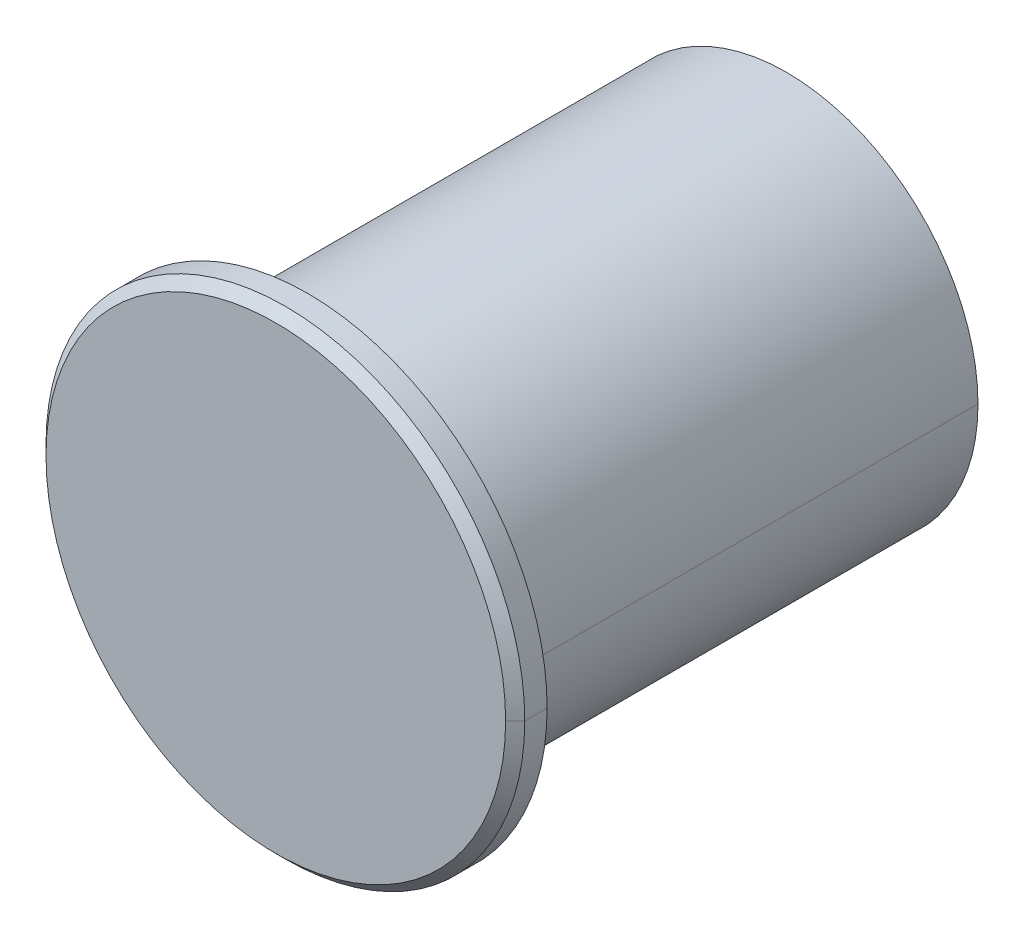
ISO-10303-21;
HEADER;
FILE_DESCRIPTION(('STEP AP214'),'2;1');
FILE_NAME('part.step','',(''),(''),'','','');
FILE_SCHEMA(('AUTOMOTIVE_DESIGN { 1 0 10303 214 1 1 1 1 }'));
ENDSEC;
DATA;
#1=APPLICATION_CONTEXT('core data for automotive mechanical design processes');
#2=APPLICATION_PROTOCOL_DEFINITION('international standard','automotive_design',2000,#1);
#3=PRODUCT_CONTEXT('',#1,'mechanical');
#4=PRODUCT('Part','Part','',(#3));
#5=PRODUCT_RELATED_PRODUCT_CATEGORY('part','',(#4));
#6=PRODUCT_DEFINITION_FORMATION('','',#4);
#7=PRODUCT_DEFINITION_CONTEXT('part definition',#1,'design');
#8=PRODUCT_DEFINITION('design','',#6,#7);
#9=PRODUCT_DEFINITION_SHAPE('','',#8);
#10=(LENGTH_UNIT() NAMED_UNIT(*) SI_UNIT(.MILLI.,.METRE.));
#11=(NAMED_UNIT(*) PLANE_ANGLE_UNIT() SI_UNIT($,.RADIAN.));
#12=(NAMED_UNIT(*) SI_UNIT($,.STERADIAN.) SOLID_ANGLE_UNIT());
#13=UNCERTAINTY_MEASURE_WITH_UNIT(LENGTH_MEASURE(1.E-05),#10,'distance_accuracy_value','');
#14=(GEOMETRIC_REPRESENTATION_CONTEXT(3) GLOBAL_UNCERTAINTY_ASSIGNED_CONTEXT((#13)) GLOBAL_UNIT_ASSIGNED_CONTEXT((#10,
#11,#12)) REPRESENTATION_CONTEXT('',''));
#15=CARTESIAN_POINT('',(0.,0.,0.));
#16=DIRECTION('',(0.,0.,1.));
#17=DIRECTION('',(1.,0.,0.));
#18=AXIS2_PLACEMENT_3D('',#15,#16,#17);
#19=CARTESIAN_POINT('',(0.,0.,0.));
#20=DIRECTION('',(0.,0.,1.));
#21=DIRECTION('',(1.,0.,0.));
#22=AXIS2_PLACEMENT_3D('',#19,#20,#21);
#23=PLANE('',#22);
#24=CARTESIAN_POINT('',(0.,0.,0.));
#25=DIRECTION('',(0.,0.,1.));
#26=DIRECTION('',(1.,0.,0.));
#27=AXIS2_PLACEMENT_3D('',#24,#25,#26);
#28=CIRCLE('',#27,7.2);
#29=CARTESIAN_POINT('',(-7.2,0.,0.));
#30=VERTEX_POINT('',#29);
#31=CARTESIAN_POINT('',(7.2,0.,0.));
#32=VERTEX_POINT('',#31);
#33=EDGE_CURVE('E9',#30,#32,#28,.T.);
#34=ORIENTED_EDGE('',*,*,#33,.T.);
#35=CARTESIAN_POINT('',(0.,0.,0.));
#36=DIRECTION('',(0.,0.,1.));
#37=DIRECTION('',(1.,0.,0.));
#38=AXIS2_PLACEMENT_3D('',#35,#36,#37);
#39=CIRCLE('',#38,7.2);
#40=EDGE_CURVE('E72',#32,#30,#39,.T.);
#41=ORIENTED_EDGE('',*,*,#40,.T.);
#42=EDGE_LOOP('',(#34,#41));
#43=FACE_BOUND('',#42,.T.);
#44=ADVANCED_FACE('F15',(#43),#23,.T.);
#45=CARTESIAN_POINT('',(0.,0.,-0.3));
#46=DIRECTION('',(0.,0.,-1.));
#47=DIRECTION('',(-1.,0.,0.));
#48=AXIS2_PLACEMENT_3D('',#45,#46,#47);
#49=CONICAL_SURFACE('',#48,7.5,0.785398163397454);
#50=DIRECTION('',(0.707106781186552,0.,-0.707106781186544));
#51=VECTOR('',#50,1.);
#52=CARTESIAN_POINT('',(7.5,0.,-0.3));
#53=LINE('',#52,#51);
#54=CARTESIAN_POINT('',(7.5,0.,-0.3));
#55=VERTEX_POINT('',#54);
#56=EDGE_CURVE('E77',#32,#55,#53,.T.);
#57=ORIENTED_EDGE('',*,*,#56,.F.);
#58=ORIENTED_EDGE('',*,*,#33,.F.);
#59=DIRECTION('',(-0.707106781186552,0.,-0.707106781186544));
#60=VECTOR('',#59,1.);
#61=CARTESIAN_POINT('',(-7.5,0.,-0.3));
#62=LINE('',#61,#60);
#63=CARTESIAN_POINT('',(-7.5,0.,-0.3));
#64=VERTEX_POINT('',#63);
#65=EDGE_CURVE('E85',#30,#64,#62,.T.);
#66=ORIENTED_EDGE('',*,*,#65,.T.);
#67=CARTESIAN_POINT('',(0.,0.,-0.3));
#68=DIRECTION('',(0.,0.,1.));
#69=DIRECTION('',(1.,0.,0.));
#70=AXIS2_PLACEMENT_3D('',#67,#68,#69);
#71=CIRCLE('',#70,7.5);
#72=EDGE_CURVE('E24',#64,#55,#71,.T.);
#73=ORIENTED_EDGE('',*,*,#72,.T.);
#74=EDGE_LOOP('',(#57,#58,#66,#73));
#75=FACE_BOUND('',#74,.T.);
#76=ADVANCED_FACE('F17',(#75),#49,.T.);
#77=CARTESIAN_POINT('',(0.,0.,1.01));
#78=DIRECTION('',(0.,0.,1.));
#79=DIRECTION('',(1.,0.,0.));
#80=AXIS2_PLACEMENT_3D('',#77,#78,#79);
#81=CYLINDRICAL_SURFACE('',#80,7.5);
#82=DIRECTION('',(0.,0.,1.));
#83=VECTOR('',#82,1.);
#84=CARTESIAN_POINT('',(-7.5,0.,1.01));
#85=LINE('',#84,#83);
#86=CARTESIAN_POINT('',(-7.5,0.,-1.));
#87=VERTEX_POINT('',#86);
#88=EDGE_CURVE('E97',#87,#64,#85,.T.);
#89=ORIENTED_EDGE('',*,*,#88,.F.);
#90=CARTESIAN_POINT('',(0.,0.,-1.));
#91=DIRECTION('',(0.,0.,1.));
#92=DIRECTION('',(1.,0.,0.));
#93=AXIS2_PLACEMENT_3D('',#90,#91,#92);
#94=CIRCLE('',#93,7.5);
#95=CARTESIAN_POINT('',(7.5,0.,-1.));
#96=VERTEX_POINT('',#95);
#97=EDGE_CURVE('E111',#87,#96,#94,.T.);
#98=ORIENTED_EDGE('',*,*,#97,.T.);
#99=DIRECTION('',(0.,0.,1.));
#100=VECTOR('',#99,1.);
#101=CARTESIAN_POINT('',(7.5,0.,1.01));
#102=LINE('',#101,#100);
#103=EDGE_CURVE('E101',#96,#55,#102,.T.);
#104=ORIENTED_EDGE('',*,*,#103,.T.);
#105=ORIENTED_EDGE('',*,*,#72,.F.);
#106=EDGE_LOOP('',(#89,#98,#104,#105));
#107=FACE_BOUND('',#106,.T.);
#108=ADVANCED_FACE('F129',(#107),#81,.T.);
#109=CARTESIAN_POINT('',(0.,6.,-1.));
#110=DIRECTION('',(0.,0.,1.));
#111=DIRECTION('',(1.,0.,0.));
#112=AXIS2_PLACEMENT_3D('',#109,#110,#111);
#113=PLANE('',#112);
#114=CARTESIAN_POINT('',(0.,0.,-1.));
#115=DIRECTION('',(0.,0.,1.));
#116=DIRECTION('',(1.,0.,0.));
#117=AXIS2_PLACEMENT_3D('',#114,#115,#116);
#118=CIRCLE('',#117,6.);
#119=CARTESIAN_POINT('',(6.,0.,-1.));
#120=VERTEX_POINT('',#119);
#121=CARTESIAN_POINT('',(-6.,0.,-1.));
#122=VERTEX_POINT('',#121);
#123=EDGE_CURVE('E116',#120,#122,#118,.T.);
#124=ORIENTED_EDGE('',*,*,#123,.T.);
#125=CARTESIAN_POINT('',(0.,0.,-1.));
#126=DIRECTION('',(0.,0.,1.));
#127=DIRECTION('',(1.,0.,0.));
#128=AXIS2_PLACEMENT_3D('',#125,#126,#127);
#129=CIRCLE('',#128,6.);
#130=EDGE_CURVE('E33',#122,#120,#129,.T.);
#131=ORIENTED_EDGE('',*,*,#130,.T.);
#132=EDGE_LOOP('',(#124,#131));
#133=FACE_BOUND('',#132,.T.);
#134=CARTESIAN_POINT('',(0.,0.,-1.));
#135=DIRECTION('',(0.,0.,1.));
#136=DIRECTION('',(1.,0.,0.));
#137=AXIS2_PLACEMENT_3D('',#134,#135,#136);
#138=CIRCLE('',#137,7.5);
#139=EDGE_CURVE('E93',#96,#87,#138,.T.);
#140=ORIENTED_EDGE('',*,*,#139,.F.);
#141=ORIENTED_EDGE('',*,*,#97,.F.);
#142=EDGE_LOOP('',(#140,#141));
#143=FACE_BOUND('',#142,.T.);
#144=ADVANCED_FACE('F135',(#133,#143),#113,.F.);
#145=CARTESIAN_POINT('',(0.,0.,-16.));
#146=DIRECTION('',(0.,0.,1.));
#147=DIRECTION('',(1.,0.,0.));
#148=AXIS2_PLACEMENT_3D('',#145,#146,#147);
#149=PLANE('',#148);
#150=CARTESIAN_POINT('',(0.,0.,-16.));
#151=DIRECTION('',(0.,0.,1.));
#152=DIRECTION('',(1.,0.,0.));
#153=AXIS2_PLACEMENT_3D('',#150,#151,#152);
#154=CIRCLE('',#153,6.);
#155=CARTESIAN_POINT('',(6.,0.,-16.));
#156=VERTEX_POINT('',#155);
#157=CARTESIAN_POINT('',(-6.,0.,-16.));
#158=VERTEX_POINT('',#157);
#159=EDGE_CURVE('E104',#156,#158,#154,.T.);
#160=ORIENTED_EDGE('',*,*,#159,.F.);
#161=CARTESIAN_POINT('',(0.,0.,-16.));
#162=DIRECTION('',(0.,0.,1.));
#163=DIRECTION('',(1.,0.,0.));
#164=AXIS2_PLACEMENT_3D('',#161,#162,#163);
#165=CIRCLE('',#164,6.);
#166=EDGE_CURVE('E112',#158,#156,#165,.T.);
#167=ORIENTED_EDGE('',*,*,#166,.F.);
#168=EDGE_LOOP('',(#160,#167));
#169=FACE_BOUND('',#168,.T.);
#170=ADVANCED_FACE('F137',(#169),#149,.F.);
#171=CARTESIAN_POINT('',(0.,0.,-16.));
#172=DIRECTION('',(0.,0.,1.));
#173=DIRECTION('',(1.,0.,0.));
#174=AXIS2_PLACEMENT_3D('',#171,#172,#173);
#175=CYLINDRICAL_SURFACE('',#174,6.);
#176=DIRECTION('',(0.,0.,1.));
#177=VECTOR('',#176,1.);
#178=CARTESIAN_POINT('',(-6.,0.,-16.));
#179=LINE('',#178,#177);
#180=EDGE_CURVE('E108',#158,#122,#179,.T.);
#181=ORIENTED_EDGE('',*,*,#180,.F.);
#182=ORIENTED_EDGE('',*,*,#166,.T.);
#183=DIRECTION('',(0.,0.,1.));
#184=VECTOR('',#183,1.);
#185=CARTESIAN_POINT('',(6.,0.,-16.));
#186=LINE('',#185,#184);
#187=EDGE_CURVE('E119',#156,#120,#186,.T.);
#188=ORIENTED_EDGE('',*,*,#187,.T.);
#189=ORIENTED_EDGE('',*,*,#130,.F.);
#190=EDGE_LOOP('',(#181,#182,#188,#189));
#191=FACE_BOUND('',#190,.T.);
#192=ADVANCED_FACE('F143',(#191),#175,.T.);
#193=CARTESIAN_POINT('',(0.,0.,-16.));
#194=DIRECTION('',(0.,0.,1.));
#195=DIRECTION('',(1.,0.,0.));
#196=AXIS2_PLACEMENT_3D('',#193,#194,#195);
#197=CYLINDRICAL_SURFACE('',#196,6.);
#198=ORIENTED_EDGE('',*,*,#159,.T.);
#199=ORIENTED_EDGE('',*,*,#180,.T.);
#200=ORIENTED_EDGE('',*,*,#123,.F.);
#201=ORIENTED_EDGE('',*,*,#187,.F.);
#202=EDGE_LOOP('',(#198,#199,#200,#201));
#203=FACE_BOUND('',#202,.T.);
#204=ADVANCED_FACE('F154',(#203),#197,.T.);
#205=CARTESIAN_POINT('',(0.,0.,1.01));
#206=DIRECTION('',(0.,0.,1.));
#207=DIRECTION('',(1.,0.,0.));
#208=AXIS2_PLACEMENT_3D('',#205,#206,#207);
#209=CYLINDRICAL_SURFACE('',#208,7.5);
#210=ORIENTED_EDGE('',*,*,#139,.T.);
#211=ORIENTED_EDGE('',*,*,#88,.T.);
#212=CARTESIAN_POINT('',(0.,0.,-0.3));
#213=DIRECTION('',(0.,0.,1.));
#214=DIRECTION('',(1.,0.,0.));
#215=AXIS2_PLACEMENT_3D('',#212,#213,#214);
#216=CIRCLE('',#215,7.5);
#217=EDGE_CURVE('E82',#55,#64,#216,.T.);
#218=ORIENTED_EDGE('',*,*,#217,.F.);
#219=ORIENTED_EDGE('',*,*,#103,.F.);
#220=EDGE_LOOP('',(#210,#211,#218,#219));
#221=FACE_BOUND('',#220,.T.);
#222=ADVANCED_FACE('F134',(#221),#209,.T.);
#223=CARTESIAN_POINT('',(0.,0.,-0.3));
#224=DIRECTION('',(0.,0.,-1.));
#225=DIRECTION('',(-1.,0.,0.));
#226=AXIS2_PLACEMENT_3D('',#223,#224,#225);
#227=CONICAL_SURFACE('',#226,7.5,0.785398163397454);
#228=ORIENTED_EDGE('',*,*,#40,.F.);
#229=ORIENTED_EDGE('',*,*,#56,.T.);
#230=ORIENTED_EDGE('',*,*,#217,.T.);
#231=ORIENTED_EDGE('',*,*,#65,.F.);
#232=EDGE_LOOP('',(#228,#229,#230,#231));
#233=FACE_BOUND('',#232,.T.);
#234=ADVANCED_FACE('F84',(#233),#227,.T.);
#235=CLOSED_SHELL('',(#44,#76,#108,#144,#170,#192,#204,#222,#234));
#236=MANIFOLD_SOLID_BREP('B1',#235);
#237=ADVANCED_BREP_SHAPE_REPRESENTATION('',(#18,#236),#14);
#238=SHAPE_DEFINITION_REPRESENTATION(#9,#237);
ENDSEC;
END-ISO-10303-21;
